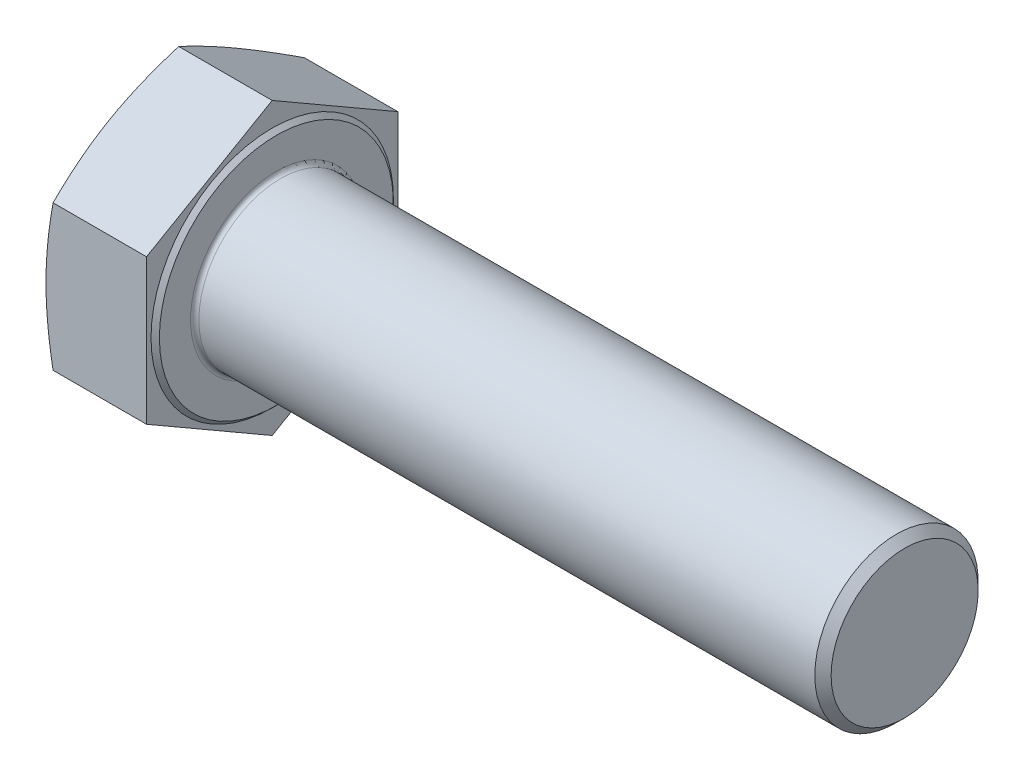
ISO-10303-21;
HEADER;
FILE_DESCRIPTION(('STEP AP214'),'2;1');
FILE_NAME('part.step','',(''),(''),'','','');
FILE_SCHEMA(('AUTOMOTIVE_DESIGN { 1 0 10303 214 1 1 1 1 }'));
ENDSEC;
DATA;
#1=APPLICATION_CONTEXT('core data for automotive mechanical design processes');
#2=APPLICATION_PROTOCOL_DEFINITION('international standard','automotive_design',2000,#1);
#3=PRODUCT_CONTEXT('',#1,'mechanical');
#4=PRODUCT('Part','Part','',(#3));
#5=PRODUCT_RELATED_PRODUCT_CATEGORY('part','',(#4));
#6=PRODUCT_DEFINITION_FORMATION('','',#4);
#7=PRODUCT_DEFINITION_CONTEXT('part definition',#1,'design');
#8=PRODUCT_DEFINITION('design','',#6,#7);
#9=PRODUCT_DEFINITION_SHAPE('','',#8);
#10=(LENGTH_UNIT() NAMED_UNIT(*) SI_UNIT(.MILLI.,.METRE.));
#11=(NAMED_UNIT(*) PLANE_ANGLE_UNIT() SI_UNIT($,.RADIAN.));
#12=(NAMED_UNIT(*) SI_UNIT($,.STERADIAN.) SOLID_ANGLE_UNIT());
#13=UNCERTAINTY_MEASURE_WITH_UNIT(LENGTH_MEASURE(1.E-05),#10,'distance_accuracy_value','');
#14=(GEOMETRIC_REPRESENTATION_CONTEXT(3) GLOBAL_UNCERTAINTY_ASSIGNED_CONTEXT((#13)) GLOBAL_UNIT_ASSIGNED_CONTEXT((#10,
#11,#12)) REPRESENTATION_CONTEXT('',''));
#15=CARTESIAN_POINT('',(0.,0.,0.));
#16=DIRECTION('',(0.,0.,1.));
#17=DIRECTION('',(1.,0.,0.));
#18=AXIS2_PLACEMENT_3D('',#15,#16,#17);
#19=CARTESIAN_POINT('',(25.,-51.9615242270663,-30.));
#20=DIRECTION('',(1.,0.,0.));
#21=DIRECTION('',(0.,0.,-1.));
#22=AXIS2_PLACEMENT_3D('',#19,#20,#21);
#23=PLANE('',#22);
#24=CARTESIAN_POINT('',(25.,0.,0.));
#25=DIRECTION('',(1.,0.,0.));
#26=DIRECTION('',(0.,0.,-1.));
#27=AXIS2_PLACEMENT_3D('',#24,#25,#26);
#28=CIRCLE('',#27,20.5);
#29=CARTESIAN_POINT('',(25.,0.,-20.5));
#30=VERTEX_POINT('',#29);
#31=EDGE_CURVE('E11',#30,#30,#28,.F.);
#32=ORIENTED_EDGE('',*,*,#31,.T.);
#33=EDGE_LOOP('',(#32));
#34=FACE_BOUND('',#33,.T.);
#35=CARTESIAN_POINT('',(25.,0.,0.));
#36=DIRECTION('',(-1.,0.,0.));
#37=DIRECTION('',(0.,0.,1.));
#38=AXIS2_PLACEMENT_3D('',#35,#36,#37);
#39=CIRCLE('',#38,27.93);
#40=CARTESIAN_POINT('',(25.,0.,27.93));
#41=VERTEX_POINT('',#40);
#42=EDGE_CURVE('E257',#41,#41,#39,.T.);
#43=ORIENTED_EDGE('',*,*,#42,.F.);
#44=EDGE_LOOP('',(#43));
#45=FACE_BOUND('',#44,.T.);
#46=ADVANCED_FACE('F32',(#34,#45),#23,.T.);
#47=CARTESIAN_POINT('',(25.,-17.3205080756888,30.));
#48=DIRECTION('',(0.,0.866025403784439,-0.5));
#49=DIRECTION('',(0.,0.5,0.866025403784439));
#50=AXIS2_PLACEMENT_3D('',#47,#48,#49);
#51=PLANE('',#50);
#52=CARTESIAN_POINT('',(1.68923376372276,-34.6411316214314,-0.00019999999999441));
#53=CARTESIAN_POINT('',(1.55868686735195,-34.2824499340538,0.621054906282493));
#54=CARTESIAN_POINT('',(1.43401492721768,-33.9232210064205,1.2432576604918));
#55=CARTESIAN_POINT('',(1.19770444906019,-33.2036598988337,2.48957405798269));
#56=CARTESIAN_POINT('',(1.08606715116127,-32.8433276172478,3.11368787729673));
#57=CARTESIAN_POINT('',(0.877055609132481,-32.1213458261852,4.36419702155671));
#58=CARTESIAN_POINT('',(0.779692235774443,-31.7596955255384,4.99059371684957));
#59=CARTESIAN_POINT('',(0.600620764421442,-31.0354291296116,6.24505991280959));
#60=CARTESIAN_POINT('',(0.518912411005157,-30.6728130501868,6.87312938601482));
#61=CARTESIAN_POINT('',(0.373046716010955,-29.9501512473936,8.12481634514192));
#62=CARTESIAN_POINT('',(0.308731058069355,-29.5901135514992,8.7484199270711));
#63=CARTESIAN_POINT('',(0.19766503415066,-28.8693558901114,9.99680881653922));
#64=CARTESIAN_POINT('',(0.150914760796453,-28.5086359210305,10.621594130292));
#65=CARTESIAN_POINT('',(0.0757926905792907,-27.786847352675,11.8717686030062));
#66=CARTESIAN_POINT('',(0.0474141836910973,-27.4257789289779,12.4971574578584));
#67=CARTESIAN_POINT('',(0.00951786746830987,-26.7033943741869,13.7483642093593));
#68=CARTESIAN_POINT('',(0.,-26.34207824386,14.3741821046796));
#69=CARTESIAN_POINT('',(0.,-25.6194459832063,15.6258178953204));
#70=CARTESIAN_POINT('',(0.00951786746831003,-25.2581298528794,16.2516357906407));
#71=CARTESIAN_POINT('',(0.0474141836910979,-24.5357452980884,17.5028425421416));
#72=CARTESIAN_POINT('',(0.0757926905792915,-24.1746768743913,18.1282313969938));
#73=CARTESIAN_POINT('',(0.150914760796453,-23.4528883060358,19.378405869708));
#74=CARTESIAN_POINT('',(0.19766503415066,-23.0921683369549,20.0031911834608));
#75=CARTESIAN_POINT('',(0.308731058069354,-22.3714106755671,21.2515800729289));
#76=CARTESIAN_POINT('',(0.373046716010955,-22.0113729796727,21.8751836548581));
#77=CARTESIAN_POINT('',(0.518912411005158,-21.2887111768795,23.1268706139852));
#78=CARTESIAN_POINT('',(0.600620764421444,-20.9260950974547,23.7549400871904));
#79=CARTESIAN_POINT('',(0.779692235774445,-20.2018287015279,25.0094062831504));
#80=CARTESIAN_POINT('',(0.877055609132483,-19.8401784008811,25.6358029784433));
#81=CARTESIAN_POINT('',(1.08606715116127,-19.1181966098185,26.8863121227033));
#82=CARTESIAN_POINT('',(1.19770444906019,-18.7578643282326,27.5104259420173));
#83=CARTESIAN_POINT('',(1.43401492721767,-18.0383032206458,28.7567423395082));
#84=CARTESIAN_POINT('',(1.55868686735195,-17.6790742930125,29.3789450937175));
#85=CARTESIAN_POINT('',(1.68923376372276,-17.3203926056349,30.0002));
#86=B_SPLINE_CURVE_WITH_KNOTS('',3,(#52,#53,#54,#55,#56,#57,#58,#59,#60,#61,#62,#63,#64,#65,#66,
#67,#68,#69,#70,#71,#72,#73,#74,#75,#76,#77,#78,#79,#80,#81,#82,#83,#84,#85),.UNSPECIFIED.,.F.,
.F.,(4,2,2,2,2,2,2,2,2,2,2,2,2,2,2,2,4),(0.,2.18744819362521,4.3751043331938,6.56441799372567,
8.7536959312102,10.9223185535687,13.0909526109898,15.2587941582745,17.4266290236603,
19.5944638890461,21.7623054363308,23.9309394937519,26.0995621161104,28.2888400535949,
30.4781537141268,32.6658098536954,34.8532580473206),.UNSPECIFIED.);
#87=CARTESIAN_POINT('',(1.68919173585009,-34.6410161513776,0.));
#88=VERTEX_POINT('',#87);
#89=CARTESIAN_POINT('',(0.,-25.9807621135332,15.));
#90=VERTEX_POINT('',#89);
#91=EDGE_CURVE('E276',#88,#90,#86,.T.);
#92=ORIENTED_EDGE('',*,*,#91,.F.);
#93=DIRECTION('',(-1.,0.,0.));
#94=VECTOR('',#93,1.);
#95=CARTESIAN_POINT('',(25.,-34.6410161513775,0.));
#96=LINE('',#95,#94);
#97=CARTESIAN_POINT('',(24.,-34.6410161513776,0.));
#98=VERTEX_POINT('',#97);
#99=EDGE_CURVE('E142',#98,#88,#96,.T.);
#100=ORIENTED_EDGE('',*,*,#99,.F.);
#101=DIRECTION('',(0.,-0.5,-0.866025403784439));
#102=VECTOR('',#101,1.);
#103=CARTESIAN_POINT('',(24.,-17.3205080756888,30.));
#104=LINE('',#103,#102);
#105=CARTESIAN_POINT('',(24.,-17.3205080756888,30.));
#106=VERTEX_POINT('',#105);
#107=EDGE_CURVE('E133',#106,#98,#104,.T.);
#108=ORIENTED_EDGE('',*,*,#107,.F.);
#109=DIRECTION('',(-1.,0.,0.));
#110=VECTOR('',#109,1.);
#111=CARTESIAN_POINT('',(25.,-17.3205080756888,30.));
#112=LINE('',#111,#110);
#113=CARTESIAN_POINT('',(1.68919173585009,-17.3205080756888,30.));
#114=VERTEX_POINT('',#113);
#115=EDGE_CURVE('E128',#106,#114,#112,.T.);
#116=ORIENTED_EDGE('',*,*,#115,.T.);
#117=EDGE_CURVE('E121',#90,#114,#86,.T.);
#118=ORIENTED_EDGE('',*,*,#117,.F.);
#119=EDGE_LOOP('',(#92,#100,#108,#116,#118));
#120=FACE_BOUND('',#119,.T.);
#121=ADVANCED_FACE('F34',(#120),#51,.F.);
#122=CARTESIAN_POINT('',(25.,-34.6410161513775,0.));
#123=DIRECTION('',(0.,0.866025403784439,0.5));
#124=DIRECTION('',(0.,-0.5,0.866025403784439));
#125=AXIS2_PLACEMENT_3D('',#122,#123,#124);
#126=PLANE('',#125);
#127=CARTESIAN_POINT('',(1.68923376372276,-17.3203926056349,-30.0002));
#128=CARTESIAN_POINT('',(1.55868686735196,-17.6790742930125,-29.3789450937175));
#129=CARTESIAN_POINT('',(1.43401492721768,-18.0383032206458,-28.7567423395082));
#130=CARTESIAN_POINT('',(1.1977044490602,-18.7578643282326,-27.5104259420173));
#131=CARTESIAN_POINT('',(1.08606715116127,-19.1181966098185,-26.8863121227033));
#132=CARTESIAN_POINT('',(0.877055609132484,-19.8401784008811,-25.6358029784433));
#133=CARTESIAN_POINT('',(0.779692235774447,-20.2018287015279,-25.0094062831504));
#134=CARTESIAN_POINT('',(0.600620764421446,-20.9260950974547,-23.7549400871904));
#135=CARTESIAN_POINT('',(0.518912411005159,-21.2887111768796,-23.1268706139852));
#136=CARTESIAN_POINT('',(0.373046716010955,-22.0113729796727,-21.8751836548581));
#137=CARTESIAN_POINT('',(0.308731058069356,-22.3714106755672,-21.2515800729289));
#138=CARTESIAN_POINT('',(0.197665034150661,-23.0921683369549,-20.0031911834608));
#139=CARTESIAN_POINT('',(0.150914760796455,-23.4528883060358,-19.378405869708));
#140=CARTESIAN_POINT('',(0.075792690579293,-24.1746768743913,-18.1282313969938));
#141=CARTESIAN_POINT('',(0.0474141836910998,-24.5357452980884,-17.5028425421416));
#142=CARTESIAN_POINT('',(0.00951786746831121,-25.2581298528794,-16.2516357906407));
#143=CARTESIAN_POINT('',(0.,-25.6194459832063,-15.6258178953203));
#144=CARTESIAN_POINT('',(0.,-26.34207824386,-14.3741821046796));
#145=CARTESIAN_POINT('',(0.00951786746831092,-26.7033943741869,-13.7483642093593));
#146=CARTESIAN_POINT('',(0.0474141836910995,-27.4257789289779,-12.4971574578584));
#147=CARTESIAN_POINT('',(0.0757926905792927,-27.786847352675,-11.8717686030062));
#148=CARTESIAN_POINT('',(0.150914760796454,-28.5086359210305,-10.621594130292));
#149=CARTESIAN_POINT('',(0.197665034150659,-28.8693558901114,-9.99680881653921));
#150=CARTESIAN_POINT('',(0.308731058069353,-29.5901135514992,-8.74841992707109));
#151=CARTESIAN_POINT('',(0.373046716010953,-29.9501512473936,-8.12481634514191));
#152=CARTESIAN_POINT('',(0.518912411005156,-30.6728130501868,-6.87312938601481));
#153=CARTESIAN_POINT('',(0.600620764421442,-31.0354291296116,-6.24505991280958));
#154=CARTESIAN_POINT('',(0.779692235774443,-31.7596955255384,-4.99059371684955));
#155=CARTESIAN_POINT('',(0.877055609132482,-32.1213458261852,-4.3641970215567));
#156=CARTESIAN_POINT('',(1.08606715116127,-32.8433276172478,-3.11368787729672));
#157=CARTESIAN_POINT('',(1.19770444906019,-33.2036598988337,-2.48957405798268));
#158=CARTESIAN_POINT('',(1.43401492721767,-33.9232210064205,-1.24325766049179));
#159=CARTESIAN_POINT('',(1.55868686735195,-34.2824499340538,-0.621054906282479));
#160=CARTESIAN_POINT('',(1.68923376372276,-34.6411316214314,0.000200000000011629));
#161=B_SPLINE_CURVE_WITH_KNOTS('',3,(#127,#128,#129,#130,#131,#132,#133,#134,#135,#136,#137,
#138,#139,#140,#141,#142,#143,#144,#145,#146,#147,#148,#149,#150,#151,#152,#153,#154,#155,#156,
#157,#158,#159,#160),.UNSPECIFIED.,.F.,.F.,(4,2,2,2,2,2,2,2,2,2,2,2,2,2,2,2,4),(0.,
2.18744819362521,4.3751043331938,6.56441799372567,8.7536959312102,10.9223185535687,
13.0909526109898,15.2587941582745,17.4266290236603,19.5944638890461,21.7623054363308,
23.9309394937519,26.0995621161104,28.2888400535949,30.4781537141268,32.6658098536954,
34.8532580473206),.UNSPECIFIED.);
#162=CARTESIAN_POINT('',(1.68919173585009,-17.3205080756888,-30.));
#163=VERTEX_POINT('',#162);
#164=CARTESIAN_POINT('',(0.,-25.9807621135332,-15.));
#165=VERTEX_POINT('',#164);
#166=EDGE_CURVE('E229',#163,#165,#161,.T.);
#167=ORIENTED_EDGE('',*,*,#166,.F.);
#168=DIRECTION('',(-1.,0.,0.));
#169=VECTOR('',#168,1.);
#170=CARTESIAN_POINT('',(25.,-17.3205080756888,-30.));
#171=LINE('',#170,#169);
#172=CARTESIAN_POINT('',(24.,-17.3205080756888,-30.));
#173=VERTEX_POINT('',#172);
#174=EDGE_CURVE('E139',#173,#163,#171,.T.);
#175=ORIENTED_EDGE('',*,*,#174,.F.);
#176=DIRECTION('',(0.,0.5,-0.866025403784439));
#177=VECTOR('',#176,1.);
#178=CARTESIAN_POINT('',(24.,-34.6410161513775,0.));
#179=LINE('',#178,#177);
#180=EDGE_CURVE('E266',#98,#173,#179,.T.);
#181=ORIENTED_EDGE('',*,*,#180,.F.);
#182=ORIENTED_EDGE('',*,*,#99,.T.);
#183=EDGE_CURVE('E225',#165,#88,#161,.T.);
#184=ORIENTED_EDGE('',*,*,#183,.F.);
#185=EDGE_LOOP('',(#167,#175,#181,#182,#184));
#186=FACE_BOUND('',#185,.T.);
#187=ADVANCED_FACE('F180',(#186),#126,.F.);
#188=CARTESIAN_POINT('',(25.,-17.3205080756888,-30.));
#189=DIRECTION('',(0.,0.,1.));
#190=DIRECTION('',(1.,0.,0.));
#191=AXIS2_PLACEMENT_3D('',#188,#189,#190);
#192=PLANE('',#191);
#193=CARTESIAN_POINT('',(9.02637073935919,-45.8586150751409,-30.));
#194=CARTESIAN_POINT('',(8.81967026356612,-45.1799707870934,-30.));
#195=CARTESIAN_POINT('',(8.61421981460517,-44.5009459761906,-30.));
#196=CARTESIAN_POINT('',(8.20609881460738,-43.1420573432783,-30.));
#197=CARTESIAN_POINT('',(8.00342827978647,-42.4621935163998,-30.));
#198=CARTESIAN_POINT('',(7.39998018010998,-40.4211378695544,-30.));
#199=CARTESIAN_POINT('',(7.0037967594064,-39.0585821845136,-30.));
#200=CARTESIAN_POINT('',(6.2257778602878,-36.3266214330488,-30.));
#201=CARTESIAN_POINT('',(5.84397053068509,-34.9572083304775,-30.));
#202=CARTESIAN_POINT('',(5.09914101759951,-32.2132888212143,-30.));
#203=CARTESIAN_POINT('',(4.73611849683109,-30.8387825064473,-30.));
#204=CARTESIAN_POINT('',(4.03785279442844,-28.1007443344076,-30.));
#205=CARTESIAN_POINT('',(3.70232229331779,-26.7372861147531,-30.));
#206=CARTESIAN_POINT('',(3.05982708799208,-24.003585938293,-30.));
#207=CARTESIAN_POINT('',(2.75286286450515,-22.6333438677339,-30.));
#208=CARTESIAN_POINT('',(2.17465811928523,-19.8857647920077,-30.));
#209=CARTESIAN_POINT('',(1.9034054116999,-18.5084303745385,-30.));
#210=CARTESIAN_POINT('',(1.40488047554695,-15.745778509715,-30.));
#211=CARTESIAN_POINT('',(1.17760677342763,-14.3604613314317,-30.));
#212=CARTESIAN_POINT('',(0.798785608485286,-11.7377758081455,-30.));
#213=CARTESIAN_POINT('',(0.641604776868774,-10.501233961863,-30.));
#214=CARTESIAN_POINT('',(0.44203025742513,-8.64256639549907,-30.));
#215=CARTESIAN_POINT('',(0.381537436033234,-8.02235678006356,-30.));
#216=CARTESIAN_POINT('',(0.273298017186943,-6.78083204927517,-30.));
#217=CARTESIAN_POINT('',(0.225551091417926,-6.15951696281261,-30.));
#218=CARTESIAN_POINT('',(0.143420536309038,-4.9164307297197,-30.));
#219=CARTESIAN_POINT('',(0.109027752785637,-4.29466018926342,-30.));
#220=CARTESIAN_POINT('',(0.0540031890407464,-3.05050798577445,-30.));
#221=CARTESIAN_POINT('',(0.0333713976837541,-2.4281263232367,-30.));
#222=CARTESIAN_POINT('',(0.00614623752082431,-1.18305707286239,-30.));
#223=CARTESIAN_POINT('',(-0.000447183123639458,-0.560369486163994,-30.));
#224=CARTESIAN_POINT('',(0.000494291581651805,0.684995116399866,-30.));
#225=CARTESIAN_POINT('',(0.00802919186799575,1.30767213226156,-30.));
#226=CARTESIAN_POINT('',(0.0371982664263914,2.5558523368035,-30.));
#227=CARTESIAN_POINT('',(0.0589037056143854,3.18135385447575,-30.));
#228=CARTESIAN_POINT('',(0.116188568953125,4.43171840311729,-30.));
#229=CARTESIAN_POINT('',(0.151768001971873,5.05658143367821,-30.));
#230=CARTESIAN_POINT('',(0.236338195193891,6.30539836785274,-30.));
#231=CARTESIAN_POINT('',(0.285328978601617,6.92935226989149,-30.));
#232=CARTESIAN_POINT('',(0.396114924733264,8.1761280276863,-30.));
#233=CARTESIAN_POINT('',(0.457910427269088,8.79894985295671,-30.));
#234=CARTESIAN_POINT('',(0.661568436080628,10.6664531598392,-30.));
#235=CARTESIAN_POINT('',(0.821633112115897,11.9091794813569,-30.));
#236=CARTESIAN_POINT('',(1.18384610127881,14.3883728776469,-30.));
#237=CARTESIAN_POINT('',(1.38599463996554,15.6248399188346,-30.));
#238=CARTESIAN_POINT('',(1.83742065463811,18.156633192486,-30.));
#239=CARTESIAN_POINT('',(2.0886254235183,19.4516133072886,-30.));
#240=CARTESIAN_POINT('',(2.62336703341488,22.034920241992,-30.));
#241=CARTESIAN_POINT('',(2.9069063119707,23.3232465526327,-30.));
#242=CARTESIAN_POINT('',(3.50036258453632,25.8941681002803,-30.));
#243=CARTESIAN_POINT('',(3.81028723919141,27.1767615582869,-30.));
#244=CARTESIAN_POINT('',(4.4514728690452,29.7365452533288,-30.));
#245=CARTESIAN_POINT('',(4.78273333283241,31.0137356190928,-30.));
#246=CARTESIAN_POINT('',(5.46303895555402,33.5651110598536,-30.));
#247=CARTESIAN_POINT('',(5.81210640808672,34.8392901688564,-30.));
#248=CARTESIAN_POINT('',(6.52444101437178,37.3836675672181,-30.));
#249=CARTESIAN_POINT('',(6.88770822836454,38.6538658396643,-30.));
#250=CARTESIAN_POINT('',(7.62584333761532,41.1906487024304,-30.));
#251=CARTESIAN_POINT('',(8.00070927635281,42.4572338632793,-30.));
#252=CARTESIAN_POINT('',(8.76008460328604,44.9875022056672,-30.));
#253=CARTESIAN_POINT('',(9.14459397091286,46.2511853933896,-30.));
#254=CARTESIAN_POINT('',(9.91736032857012,48.7621368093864,-30.));
#255=CARTESIAN_POINT('',(10.3055290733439,50.0094322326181,-30.));
#256=CARTESIAN_POINT('',(11.0884787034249,52.5019440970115,-30.));
#257=CARTESIAN_POINT('',(11.483259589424,53.7471605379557,-30.));
#258=CARTESIAN_POINT('',(12.2784404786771,56.2358593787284,-30.));
#259=CARTESIAN_POINT('',(12.6788407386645,57.4793416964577,-30.));
#260=CARTESIAN_POINT('',(13.4844190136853,59.964758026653,-30.));
#261=CARTESIAN_POINT('',(13.8895970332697,61.206692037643,-30.));
#262=CARTESIAN_POINT('',(14.7025081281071,63.6845021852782,-30.));
#263=CARTESIAN_POINT('',(15.1102256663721,64.9203834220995,-30.));
#264=CARTESIAN_POINT('',(15.9291790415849,67.3909799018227,-30.));
#265=CARTESIAN_POINT('',(16.3404148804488,68.6256951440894,-30.));
#266=CARTESIAN_POINT('',(17.1659073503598,71.0940025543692,-30.));
#267=CARTESIAN_POINT('',(17.5801637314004,72.327594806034,-30.));
#268=CARTESIAN_POINT('',(18.4113570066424,74.7938727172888,-30.));
#269=CARTESIAN_POINT('',(18.8282938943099,76.0265583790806,-30.));
#270=CARTESIAN_POINT('',(19.246385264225,77.2588513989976,-30.));
#271=B_SPLINE_CURVE_WITH_KNOTS('',3,(#193,#194,#195,#196,#197,#198,#199,#200,#201,#202,#203,
#204,#205,#206,#207,#208,#209,#210,#211,#212,#213,#214,#215,#216,#217,#218,#219,#220,#221,#222,
#223,#224,#225,#226,#227,#228,#229,#230,#231,#232,#233,#234,#235,#236,#237,#238,#239,#240,#241,
#242,#243,#244,#245,#246,#247,#248,#249,#250,#251,#252,#253,#254,#255,#256,#257,#258,#259,#260,
#261,#262,#263,#264,#265,#266,#267,#268,#269,#270),.UNSPECIFIED.,.F.,.F.,(4,2,2,2,2,2,2,2,2,2,2,
2,2,2,2,2,2,2,2,2,2,2,2,2,2,2,2,2,2,2,2,2,2,2,2,2,2,2,4),(0.,2.12827131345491,4.25655503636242,
8.51343710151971,12.778261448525,17.0430091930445,21.2551748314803,25.4674113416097,
29.6782067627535,33.8888610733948,37.6274208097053,39.4967685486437,41.3660681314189,
43.234084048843,45.1020984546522,46.9701059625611,48.8381141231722,50.7155897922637,
52.5930666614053,54.4705467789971,56.3480767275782,60.1061206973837,63.8641848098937,
67.8210310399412,71.7781757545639,75.7364733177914,79.6946760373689,83.6579620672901,
87.6212649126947,91.5839028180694,95.5465322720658,99.4654120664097,103.384292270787,
107.303352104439,111.222415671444,115.126602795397,119.030792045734,122.934661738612,
126.838521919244),.UNSPECIFIED.);
#272=CARTESIAN_POINT('',(1.68919173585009,17.3205080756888,-30.));
#273=VERTEX_POINT('',#272);
#274=CARTESIAN_POINT('',(0.,0.,-30.));
#275=VERTEX_POINT('',#274);
#276=EDGE_CURVE('E292',#273,#275,#271,.F.);
#277=ORIENTED_EDGE('',*,*,#276,.F.);
#278=DIRECTION('',(-1.,0.,0.));
#279=VECTOR('',#278,1.);
#280=CARTESIAN_POINT('',(25.,17.3205080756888,-30.));
#281=LINE('',#280,#279);
#282=CARTESIAN_POINT('',(24.,17.3205080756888,-30.));
#283=VERTEX_POINT('',#282);
#284=EDGE_CURVE('E130',#283,#273,#281,.T.);
#285=ORIENTED_EDGE('',*,*,#284,.F.);
#286=DIRECTION('',(0.,1.,0.));
#287=VECTOR('',#286,1.);
#288=CARTESIAN_POINT('',(24.,-17.3205080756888,-30.));
#289=LINE('',#288,#287);
#290=EDGE_CURVE('E259',#173,#283,#289,.T.);
#291=ORIENTED_EDGE('',*,*,#290,.F.);
#292=ORIENTED_EDGE('',*,*,#174,.T.);
#293=EDGE_CURVE('E230',#275,#163,#271,.F.);
#294=ORIENTED_EDGE('',*,*,#293,.F.);
#295=EDGE_LOOP('',(#277,#285,#291,#292,#294));
#296=FACE_BOUND('',#295,.T.);
#297=ADVANCED_FACE('F238',(#296),#192,.F.);
#298=CARTESIAN_POINT('',(25.,17.3205080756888,-30.));
#299=DIRECTION('',(0.,-0.866025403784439,0.5));
#300=DIRECTION('',(0.,-0.5,-0.866025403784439));
#301=AXIS2_PLACEMENT_3D('',#298,#299,#300);
#302=PLANE('',#301);
#303=CARTESIAN_POINT('',(1.68923376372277,34.6411316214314,0.000199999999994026));
#304=CARTESIAN_POINT('',(1.55868686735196,34.2824499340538,-0.621054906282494));
#305=CARTESIAN_POINT('',(1.43401492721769,33.9232210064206,-1.24325766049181));
#306=CARTESIAN_POINT('',(1.1977044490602,33.2036598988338,-2.48957405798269));
#307=CARTESIAN_POINT('',(1.08606715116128,32.8433276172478,-3.11368787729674));
#308=CARTESIAN_POINT('',(0.877055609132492,32.1213458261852,-4.36419702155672));
#309=CARTESIAN_POINT('',(0.779692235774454,31.7596955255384,-4.99059371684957));
#310=CARTESIAN_POINT('',(0.600620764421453,31.0354291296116,-6.2450599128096));
#311=CARTESIAN_POINT('',(0.518912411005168,30.6728130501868,-6.87312938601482));
#312=CARTESIAN_POINT('',(0.373046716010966,29.9501512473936,-8.12481634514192));
#313=CARTESIAN_POINT('',(0.308731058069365,29.5901135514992,-8.7484199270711));
#314=CARTESIAN_POINT('',(0.19766503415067,28.8693558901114,-9.99680881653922));
#315=CARTESIAN_POINT('',(0.150914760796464,28.5086359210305,-10.621594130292));
#316=CARTESIAN_POINT('',(0.0757926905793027,27.786847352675,-11.8717686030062));
#317=CARTESIAN_POINT('',(0.0474141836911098,27.4257789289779,-12.4971574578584));
#318=CARTESIAN_POINT('',(0.00951786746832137,26.703394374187,-13.7483642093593));
#319=CARTESIAN_POINT('',(0.,26.3420782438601,-14.3741821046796));
#320=CARTESIAN_POINT('',(0.,25.6194459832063,-15.6258178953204));
#321=CARTESIAN_POINT('',(0.00951786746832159,25.2581298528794,-16.2516357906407));
#322=CARTESIAN_POINT('',(0.0474141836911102,24.5357452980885,-17.5028425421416));
#323=CARTESIAN_POINT('',(0.0757926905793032,24.1746768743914,-18.1282313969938));
#324=CARTESIAN_POINT('',(0.150914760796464,23.4528883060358,-19.378405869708));
#325=CARTESIAN_POINT('',(0.19766503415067,23.0921683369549,-20.0031911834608));
#326=CARTESIAN_POINT('',(0.308731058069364,22.3714106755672,-21.2515800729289));
#327=CARTESIAN_POINT('',(0.373046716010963,22.0113729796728,-21.8751836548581));
#328=CARTESIAN_POINT('',(0.518912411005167,21.2887111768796,-23.1268706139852));
#329=CARTESIAN_POINT('',(0.600620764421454,20.9260950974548,-23.7549400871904));
#330=CARTESIAN_POINT('',(0.779692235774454,20.201828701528,-25.0094062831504));
#331=CARTESIAN_POINT('',(0.87705560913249,19.8401784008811,-25.6358029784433));
#332=CARTESIAN_POINT('',(1.08606715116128,19.1181966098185,-26.8863121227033));
#333=CARTESIAN_POINT('',(1.1977044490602,18.7578643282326,-27.5104259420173));
#334=CARTESIAN_POINT('',(1.43401492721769,18.0383032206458,-28.7567423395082));
#335=CARTESIAN_POINT('',(1.55868686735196,17.6790742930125,-29.3789450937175));
#336=CARTESIAN_POINT('',(1.68923376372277,17.320392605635,-30.0002));
#337=B_SPLINE_CURVE_WITH_KNOTS('',3,(#303,#304,#305,#306,#307,#308,#309,#310,#311,#312,#313,
#314,#315,#316,#317,#318,#319,#320,#321,#322,#323,#324,#325,#326,#327,#328,#329,#330,#331,#332,
#333,#334,#335,#336),.UNSPECIFIED.,.F.,.F.,(4,2,2,2,2,2,2,2,2,2,2,2,2,2,2,2,4),(0.,
2.18744819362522,4.37510433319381,6.56441799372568,8.7536959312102,10.9223185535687,
13.0909526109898,15.2587941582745,17.4266290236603,19.5944638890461,21.7623054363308,
23.9309394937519,26.0995621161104,28.2888400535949,30.4781537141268,32.6658098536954,
34.8532580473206),.UNSPECIFIED.);
#338=CARTESIAN_POINT('',(1.68919173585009,34.6410161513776,0.));
#339=VERTEX_POINT('',#338);
#340=CARTESIAN_POINT('',(0.,25.9807621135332,-15.));
#341=VERTEX_POINT('',#340);
#342=EDGE_CURVE('E48',#339,#341,#337,.T.);
#343=ORIENTED_EDGE('',*,*,#342,.F.);
#344=DIRECTION('',(-1.,0.,0.));
#345=VECTOR('',#344,1.);
#346=CARTESIAN_POINT('',(25.,34.6410161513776,0.));
#347=LINE('',#346,#345);
#348=CARTESIAN_POINT('',(24.,34.6410161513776,0.));
#349=VERTEX_POINT('',#348);
#350=EDGE_CURVE('E127',#349,#339,#347,.T.);
#351=ORIENTED_EDGE('',*,*,#350,.F.);
#352=DIRECTION('',(0.,0.5,0.866025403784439));
#353=VECTOR('',#352,1.);
#354=CARTESIAN_POINT('',(24.,17.3205080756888,-30.));
#355=LINE('',#354,#353);
#356=EDGE_CURVE('E256',#283,#349,#355,.T.);
#357=ORIENTED_EDGE('',*,*,#356,.F.);
#358=ORIENTED_EDGE('',*,*,#284,.T.);
#359=EDGE_CURVE('E253',#341,#273,#337,.T.);
#360=ORIENTED_EDGE('',*,*,#359,.F.);
#361=EDGE_LOOP('',(#343,#351,#357,#358,#360));
#362=FACE_BOUND('',#361,.T.);
#363=ADVANCED_FACE('F242',(#362),#302,.F.);
#364=CARTESIAN_POINT('',(25.,34.6410161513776,0.));
#365=DIRECTION('',(0.,-0.866025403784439,-0.5));
#366=DIRECTION('',(0.,0.5,-0.866025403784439));
#367=AXIS2_PLACEMENT_3D('',#364,#365,#366);
#368=PLANE('',#367);
#369=CARTESIAN_POINT('',(1.68923376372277,17.320392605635,30.0002));
#370=CARTESIAN_POINT('',(1.55868686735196,17.6790742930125,29.3789450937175));
#371=CARTESIAN_POINT('',(1.43401492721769,18.0383032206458,28.7567423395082));
#372=CARTESIAN_POINT('',(1.1977044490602,18.7578643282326,27.5104259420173));
#373=CARTESIAN_POINT('',(1.08606715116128,19.1181966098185,26.8863121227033));
#374=CARTESIAN_POINT('',(0.87705560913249,19.8401784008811,25.6358029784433));
#375=CARTESIAN_POINT('',(0.779692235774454,20.2018287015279,25.0094062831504));
#376=CARTESIAN_POINT('',(0.600620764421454,20.9260950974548,23.7549400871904));
#377=CARTESIAN_POINT('',(0.518912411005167,21.2887111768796,23.1268706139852));
#378=CARTESIAN_POINT('',(0.373046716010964,22.0113729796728,21.8751836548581));
#379=CARTESIAN_POINT('',(0.308731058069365,22.3714106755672,21.2515800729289));
#380=CARTESIAN_POINT('',(0.19766503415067,23.0921683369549,20.0031911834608));
#381=CARTESIAN_POINT('',(0.150914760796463,23.4528883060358,19.378405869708));
#382=CARTESIAN_POINT('',(0.0757926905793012,24.1746768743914,18.1282313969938));
#383=CARTESIAN_POINT('',(0.0474141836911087,24.5357452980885,17.5028425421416));
#384=CARTESIAN_POINT('',(0.00951786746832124,25.2581298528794,16.2516357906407));
#385=CARTESIAN_POINT('',(0.,25.6194459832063,15.6258178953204));
#386=CARTESIAN_POINT('',(0.,26.3420782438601,14.3741821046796));
#387=CARTESIAN_POINT('',(0.00951786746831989,26.703394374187,13.7483642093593));
#388=CARTESIAN_POINT('',(0.0474141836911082,27.4257789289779,12.4971574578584));
#389=CARTESIAN_POINT('',(0.0757926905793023,27.786847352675,11.8717686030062));
#390=CARTESIAN_POINT('',(0.150914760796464,28.5086359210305,10.621594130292));
#391=CARTESIAN_POINT('',(0.197665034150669,28.8693558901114,9.99680881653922));
#392=CARTESIAN_POINT('',(0.308731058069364,29.5901135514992,8.7484199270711));
#393=CARTESIAN_POINT('',(0.373046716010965,29.9501512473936,8.12481634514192));
#394=CARTESIAN_POINT('',(0.518912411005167,30.6728130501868,6.87312938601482));
#395=CARTESIAN_POINT('',(0.600620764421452,31.0354291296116,6.24505991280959));
#396=CARTESIAN_POINT('',(0.779692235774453,31.7596955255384,4.99059371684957));
#397=CARTESIAN_POINT('',(0.877055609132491,32.1213458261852,4.36419702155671));
#398=CARTESIAN_POINT('',(1.08606715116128,32.8433276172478,3.11368787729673));
#399=CARTESIAN_POINT('',(1.1977044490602,33.2036598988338,2.48957405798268));
#400=CARTESIAN_POINT('',(1.43401492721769,33.9232210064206,1.2432576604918));
#401=CARTESIAN_POINT('',(1.55868686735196,34.2824499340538,0.621054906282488));
#402=CARTESIAN_POINT('',(1.68923376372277,34.6411316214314,-0.000200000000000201));
#403=B_SPLINE_CURVE_WITH_KNOTS('',3,(#369,#370,#371,#372,#373,#374,#375,#376,#377,#378,#379,
#380,#381,#382,#383,#384,#385,#386,#387,#388,#389,#390,#391,#392,#393,#394,#395,#396,#397,#398,
#399,#400,#401,#402),.UNSPECIFIED.,.F.,.F.,(4,2,2,2,2,2,2,2,2,2,2,2,2,2,2,2,4),(0.,
2.18744819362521,4.3751043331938,6.56441799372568,8.7536959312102,10.9223185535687,
13.0909526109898,15.2587941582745,17.4266290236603,19.5944638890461,21.7623054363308,
23.9309394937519,26.0995621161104,28.2888400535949,30.4781537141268,32.6658098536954,
34.8532580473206),.UNSPECIFIED.);
#404=CARTESIAN_POINT('',(1.68919173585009,17.3205080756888,30.));
#405=VERTEX_POINT('',#404);
#406=CARTESIAN_POINT('',(0.,25.9807621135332,15.));
#407=VERTEX_POINT('',#406);
#408=EDGE_CURVE('E56',#405,#407,#403,.T.);
#409=ORIENTED_EDGE('',*,*,#408,.F.);
#410=DIRECTION('',(-1.,0.,0.));
#411=VECTOR('',#410,1.);
#412=CARTESIAN_POINT('',(25.,17.3205080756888,30.));
#413=LINE('',#412,#411);
#414=CARTESIAN_POINT('',(24.,17.3205080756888,30.));
#415=VERTEX_POINT('',#414);
#416=EDGE_CURVE('E118',#415,#405,#413,.T.);
#417=ORIENTED_EDGE('',*,*,#416,.F.);
#418=DIRECTION('',(0.,-0.5,0.866025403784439));
#419=VECTOR('',#418,1.);
#420=CARTESIAN_POINT('',(24.,34.6410161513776,0.));
#421=LINE('',#420,#419);
#422=EDGE_CURVE('E254',#349,#415,#421,.T.);
#423=ORIENTED_EDGE('',*,*,#422,.F.);
#424=ORIENTED_EDGE('',*,*,#350,.T.);
#425=EDGE_CURVE('E120',#407,#339,#403,.T.);
#426=ORIENTED_EDGE('',*,*,#425,.F.);
#427=EDGE_LOOP('',(#409,#417,#423,#424,#426));
#428=FACE_BOUND('',#427,.T.);
#429=ADVANCED_FACE('F116',(#428),#368,.F.);
#430=CARTESIAN_POINT('',(25.,17.3205080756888,30.));
#431=DIRECTION('',(0.,0.,-1.));
#432=DIRECTION('',(0.,1.,0.));
#433=AXIS2_PLACEMENT_3D('',#430,#431,#432);
#434=PLANE('',#433);
#435=CARTESIAN_POINT('',(9.02637073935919,-45.8586150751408,30.));
#436=CARTESIAN_POINT('',(8.81967026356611,-45.1799707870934,30.));
#437=CARTESIAN_POINT('',(8.61421981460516,-44.5009459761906,30.));
#438=CARTESIAN_POINT('',(8.20609881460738,-43.1420573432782,30.));
#439=CARTESIAN_POINT('',(8.00342827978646,-42.4621935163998,30.));
#440=CARTESIAN_POINT('',(7.39998018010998,-40.4211378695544,30.));
#441=CARTESIAN_POINT('',(7.0037967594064,-39.0585821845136,30.));
#442=CARTESIAN_POINT('',(6.22577786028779,-36.3266214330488,30.));
#443=CARTESIAN_POINT('',(5.84397053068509,-34.9572083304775,30.));
#444=CARTESIAN_POINT('',(5.09914101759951,-32.2132888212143,30.));
#445=CARTESIAN_POINT('',(4.73611849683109,-30.8387825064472,30.));
#446=CARTESIAN_POINT('',(4.03785279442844,-28.1007443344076,30.));
#447=CARTESIAN_POINT('',(3.70232229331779,-26.7372861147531,30.));
#448=CARTESIAN_POINT('',(3.05982708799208,-24.003585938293,30.));
#449=CARTESIAN_POINT('',(2.75286286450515,-22.6333438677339,30.));
#450=CARTESIAN_POINT('',(2.17465811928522,-19.8857647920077,30.));
#451=CARTESIAN_POINT('',(1.90340541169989,-18.5084303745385,30.));
#452=CARTESIAN_POINT('',(1.40488047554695,-15.745778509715,30.));
#453=CARTESIAN_POINT('',(1.17760677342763,-14.3604613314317,30.));
#454=CARTESIAN_POINT('',(0.798785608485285,-11.7377758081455,30.));
#455=CARTESIAN_POINT('',(0.641604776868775,-10.501233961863,30.));
#456=CARTESIAN_POINT('',(0.44203025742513,-8.64256639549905,30.));
#457=CARTESIAN_POINT('',(0.381537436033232,-8.02235678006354,30.));
#458=CARTESIAN_POINT('',(0.273298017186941,-6.78083204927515,30.));
#459=CARTESIAN_POINT('',(0.225551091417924,-6.15951696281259,30.));
#460=CARTESIAN_POINT('',(0.143420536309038,-4.91643072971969,30.));
#461=CARTESIAN_POINT('',(0.109027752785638,-4.29466018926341,30.));
#462=CARTESIAN_POINT('',(0.0540031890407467,-3.05050798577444,30.));
#463=CARTESIAN_POINT('',(0.0333713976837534,-2.42812632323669,30.));
#464=CARTESIAN_POINT('',(0.00614623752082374,-1.18305707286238,30.));
#465=CARTESIAN_POINT('',(-0.000447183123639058,-0.560369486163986,30.));
#466=CARTESIAN_POINT('',(0.000494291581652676,0.684995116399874,30.));
#467=CARTESIAN_POINT('',(0.00802919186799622,1.30767213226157,30.));
#468=CARTESIAN_POINT('',(0.0371982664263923,2.55585233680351,30.));
#469=CARTESIAN_POINT('',(0.0589037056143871,3.18135385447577,30.));
#470=CARTESIAN_POINT('',(0.116188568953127,4.43171840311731,30.));
#471=CARTESIAN_POINT('',(0.151768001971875,5.05658143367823,30.));
#472=CARTESIAN_POINT('',(0.236338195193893,6.30539836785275,30.));
#473=CARTESIAN_POINT('',(0.285328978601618,6.9293522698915,30.));
#474=CARTESIAN_POINT('',(0.396114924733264,8.17612802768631,30.));
#475=CARTESIAN_POINT('',(0.457910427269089,8.79894985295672,30.));
#476=CARTESIAN_POINT('',(0.661568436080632,10.6664531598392,30.));
#477=CARTESIAN_POINT('',(0.821633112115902,11.9091794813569,30.));
#478=CARTESIAN_POINT('',(1.18384610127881,14.3883728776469,30.));
#479=CARTESIAN_POINT('',(1.38599463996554,15.6248399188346,30.));
#480=CARTESIAN_POINT('',(1.83742065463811,18.156633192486,30.));
#481=CARTESIAN_POINT('',(2.0886254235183,19.4516133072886,30.));
#482=CARTESIAN_POINT('',(2.62336703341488,22.034920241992,30.));
#483=CARTESIAN_POINT('',(2.9069063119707,23.3232465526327,30.));
#484=CARTESIAN_POINT('',(3.50036258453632,25.8941681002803,30.));
#485=CARTESIAN_POINT('',(3.81028723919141,27.1767615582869,30.));
#486=CARTESIAN_POINT('',(4.4514728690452,29.7365452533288,30.));
#487=CARTESIAN_POINT('',(4.78273333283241,31.0137356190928,30.));
#488=CARTESIAN_POINT('',(5.46303895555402,33.5651110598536,30.));
#489=CARTESIAN_POINT('',(5.81210640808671,34.8392901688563,30.));
#490=CARTESIAN_POINT('',(6.52444101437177,37.3836675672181,30.));
#491=CARTESIAN_POINT('',(6.88770822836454,38.6538658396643,30.));
#492=CARTESIAN_POINT('',(7.62584333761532,41.1906487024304,30.));
#493=CARTESIAN_POINT('',(8.00070927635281,42.4572338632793,30.));
#494=CARTESIAN_POINT('',(8.76008460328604,44.9875022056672,30.));
#495=CARTESIAN_POINT('',(9.14459397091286,46.2511853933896,30.));
#496=CARTESIAN_POINT('',(9.91736032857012,48.7621368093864,30.));
#497=CARTESIAN_POINT('',(10.3055290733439,50.0094322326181,30.));
#498=CARTESIAN_POINT('',(11.0884787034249,52.5019440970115,30.));
#499=CARTESIAN_POINT('',(11.483259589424,53.7471605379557,30.));
#500=CARTESIAN_POINT('',(12.2784404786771,56.2358593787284,30.));
#501=CARTESIAN_POINT('',(12.6788407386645,57.4793416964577,30.));
#502=CARTESIAN_POINT('',(13.4844190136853,59.9647580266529,30.));
#503=CARTESIAN_POINT('',(13.8895970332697,61.206692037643,30.));
#504=CARTESIAN_POINT('',(14.7025081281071,63.6845021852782,30.));
#505=CARTESIAN_POINT('',(15.1102256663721,64.9203834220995,30.));
#506=CARTESIAN_POINT('',(15.9291790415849,67.3909799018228,30.));
#507=CARTESIAN_POINT('',(16.3404148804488,68.6256951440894,30.));
#508=CARTESIAN_POINT('',(17.1659073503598,71.0940025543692,30.));
#509=CARTESIAN_POINT('',(17.5801637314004,72.327594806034,30.));
#510=CARTESIAN_POINT('',(18.4113570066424,74.7938727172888,30.));
#511=CARTESIAN_POINT('',(18.8282938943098,76.0265583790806,30.));
#512=CARTESIAN_POINT('',(19.246385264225,77.2588513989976,30.));
#513=B_SPLINE_CURVE_WITH_KNOTS('',3,(#435,#436,#437,#438,#439,#440,#441,#442,#443,#444,#445,
#446,#447,#448,#449,#450,#451,#452,#453,#454,#455,#456,#457,#458,#459,#460,#461,#462,#463,#464,
#465,#466,#467,#468,#469,#470,#471,#472,#473,#474,#475,#476,#477,#478,#479,#480,#481,#482,#483,
#484,#485,#486,#487,#488,#489,#490,#491,#492,#493,#494,#495,#496,#497,#498,#499,#500,#501,#502,
#503,#504,#505,#506,#507,#508,#509,#510,#511,#512),.UNSPECIFIED.,.F.,.F.,(4,2,2,2,2,2,2,2,2,2,2,
2,2,2,2,2,2,2,2,2,2,2,2,2,2,2,2,2,2,2,2,2,2,2,2,2,2,2,4),(0.,2.12827131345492,4.25655503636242,
8.5134371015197,12.778261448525,17.0430091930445,21.2551748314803,25.4674113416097,
29.6782067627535,33.8888610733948,37.6274208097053,39.4967685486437,41.3660681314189,
43.234084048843,45.1020984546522,46.970105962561,48.8381141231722,50.7155897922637,
52.5930666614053,54.4705467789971,56.3480767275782,60.1061206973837,63.8641848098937,
67.8210310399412,71.7781757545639,75.7364733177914,79.6946760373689,83.6579620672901,
87.6212649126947,91.5839028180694,95.5465322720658,99.4654120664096,103.384292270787,
107.303352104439,111.222415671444,115.126602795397,119.030792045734,122.934661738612,
126.838521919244),.UNSPECIFIED.);
#514=CARTESIAN_POINT('',(0.,0.,30.));
#515=VERTEX_POINT('',#514);
#516=EDGE_CURVE('E111',#114,#515,#513,.T.);
#517=ORIENTED_EDGE('',*,*,#516,.F.);
#518=ORIENTED_EDGE('',*,*,#115,.F.);
#519=DIRECTION('',(0.,-1.,0.));
#520=VECTOR('',#519,1.);
#521=CARTESIAN_POINT('',(24.,17.3205080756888,30.));
#522=LINE('',#521,#520);
#523=EDGE_CURVE('E126',#415,#106,#522,.T.);
#524=ORIENTED_EDGE('',*,*,#523,.F.);
#525=ORIENTED_EDGE('',*,*,#416,.T.);
#526=EDGE_CURVE('E103',#515,#405,#513,.T.);
#527=ORIENTED_EDGE('',*,*,#526,.F.);
#528=EDGE_LOOP('',(#517,#518,#524,#525,#527));
#529=FACE_BOUND('',#528,.T.);
#530=ADVANCED_FACE('F124',(#529),#434,.F.);
#531=CARTESIAN_POINT('',(24.,28.93,0.));
#532=DIRECTION('',(1.,0.,0.));
#533=DIRECTION('',(0.,0.,-1.));
#534=AXIS2_PLACEMENT_3D('',#531,#532,#533);
#535=PLANE('',#534);
#536=CARTESIAN_POINT('',(24.,0.,0.));
#537=DIRECTION('',(-1.,0.,0.));
#538=DIRECTION('',(0.,0.,1.));
#539=AXIS2_PLACEMENT_3D('',#536,#537,#538);
#540=CIRCLE('',#539,28.93);
#541=CARTESIAN_POINT('',(24.,0.,28.93));
#542=VERTEX_POINT('',#541);
#543=EDGE_CURVE('E262',#542,#542,#540,.T.);
#544=ORIENTED_EDGE('',*,*,#543,.T.);
#545=EDGE_LOOP('',(#544));
#546=FACE_BOUND('',#545,.T.);
#547=ORIENTED_EDGE('',*,*,#107,.T.);
#548=ORIENTED_EDGE('',*,*,#180,.T.);
#549=ORIENTED_EDGE('',*,*,#290,.T.);
#550=ORIENTED_EDGE('',*,*,#356,.T.);
#551=ORIENTED_EDGE('',*,*,#422,.T.);
#552=ORIENTED_EDGE('',*,*,#523,.T.);
#553=EDGE_LOOP('',(#547,#548,#549,#550,#551,#552));
#554=FACE_BOUND('',#553,.T.);
#555=ADVANCED_FACE('F190',(#546,#554),#535,.T.);
#556=CARTESIAN_POINT('',(24.,0.,0.));
#557=DIRECTION('',(-1.,0.,0.));
#558=DIRECTION('',(0.,0.,1.));
#559=AXIS2_PLACEMENT_3D('',#556,#557,#558);
#560=CONICAL_SURFACE('',#559,28.93,0.78539816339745);
#561=ORIENTED_EDGE('',*,*,#42,.T.);
#562=EDGE_LOOP('',(#561));
#563=FACE_BOUND('',#562,.T.);
#564=ORIENTED_EDGE('',*,*,#543,.F.);
#565=EDGE_LOOP('',(#564));
#566=FACE_BOUND('',#565,.T.);
#567=ADVANCED_FACE('F297',(#563,#566),#560,.T.);
#568=CARTESIAN_POINT('',(0.,0.,0.));
#569=DIRECTION('',(1.,0.,0.));
#570=DIRECTION('',(0.,0.,-1.));
#571=AXIS2_PLACEMENT_3D('',#568,#569,#570);
#572=CONICAL_SURFACE('',#571,30.,1.22173047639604);
#573=ORIENTED_EDGE('',*,*,#293,.T.);
#574=ORIENTED_EDGE('',*,*,#166,.T.);
#575=CARTESIAN_POINT('',(0.,0.,0.));
#576=DIRECTION('',(1.,0.,0.));
#577=DIRECTION('',(0.,0.,-1.));
#578=AXIS2_PLACEMENT_3D('',#575,#576,#577);
#579=CIRCLE('',#578,30.);
#580=EDGE_CURVE('E146',#165,#275,#579,.T.);
#581=ORIENTED_EDGE('',*,*,#580,.T.);
#582=EDGE_LOOP('',(#573,#574,#581));
#583=FACE_BOUND('',#582,.T.);
#584=ADVANCED_FACE('F209',(#583),#572,.T.);
#585=ORIENTED_EDGE('',*,*,#183,.T.);
#586=ORIENTED_EDGE('',*,*,#91,.T.);
#587=EDGE_CURVE('E149',#90,#165,#579,.T.);
#588=ORIENTED_EDGE('',*,*,#587,.T.);
#589=EDGE_LOOP('',(#585,#586,#588));
#590=FACE_BOUND('',#589,.T.);
#591=ADVANCED_FACE('F288',(#590),#572,.T.);
#592=ORIENTED_EDGE('',*,*,#117,.T.);
#593=ORIENTED_EDGE('',*,*,#516,.T.);
#594=EDGE_CURVE('E281',#515,#90,#579,.T.);
#595=ORIENTED_EDGE('',*,*,#594,.T.);
#596=EDGE_LOOP('',(#592,#593,#595));
#597=FACE_BOUND('',#596,.T.);
#598=ADVANCED_FACE('F280',(#597),#572,.T.);
#599=ORIENTED_EDGE('',*,*,#408,.T.);
#600=CARTESIAN_POINT('',(0.,0.,0.));
#601=DIRECTION('',(-1.,0.,0.));
#602=DIRECTION('',(0.,0.,1.));
#603=AXIS2_PLACEMENT_3D('',#600,#601,#602);
#604=CIRCLE('',#603,30.);
#605=EDGE_CURVE('E106',#515,#407,#604,.T.);
#606=ORIENTED_EDGE('',*,*,#605,.F.);
#607=ORIENTED_EDGE('',*,*,#526,.T.);
#608=EDGE_LOOP('',(#599,#606,#607));
#609=FACE_BOUND('',#608,.T.);
#610=ADVANCED_FACE('F104',(#609),#572,.T.);
#611=ORIENTED_EDGE('',*,*,#342,.T.);
#612=EDGE_CURVE('E284',#341,#407,#579,.T.);
#613=ORIENTED_EDGE('',*,*,#612,.T.);
#614=ORIENTED_EDGE('',*,*,#425,.T.);
#615=EDGE_LOOP('',(#611,#613,#614));
#616=FACE_BOUND('',#615,.T.);
#617=ADVANCED_FACE('F207',(#616),#572,.T.);
#618=ORIENTED_EDGE('',*,*,#276,.T.);
#619=EDGE_CURVE('E150',#275,#341,#579,.T.);
#620=ORIENTED_EDGE('',*,*,#619,.T.);
#621=ORIENTED_EDGE('',*,*,#359,.T.);
#622=EDGE_LOOP('',(#618,#620,#621));
#623=FACE_BOUND('',#622,.T.);
#624=ADVANCED_FACE('F202',(#623),#572,.T.);
#625=CARTESIAN_POINT('',(0.,-51.9615242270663,-30.));
#626=DIRECTION('',(1.,0.,0.));
#627=DIRECTION('',(0.,0.,-1.));
#628=AXIS2_PLACEMENT_3D('',#625,#626,#627);
#629=PLANE('',#628);
#630=ORIENTED_EDGE('',*,*,#619,.F.);
#631=ORIENTED_EDGE('',*,*,#580,.F.);
#632=ORIENTED_EDGE('',*,*,#587,.F.);
#633=ORIENTED_EDGE('',*,*,#594,.F.);
#634=ORIENTED_EDGE('',*,*,#605,.T.);
#635=ORIENTED_EDGE('',*,*,#612,.F.);
#636=EDGE_LOOP('',(#630,#631,#632,#633,#634,#635));
#637=FACE_BOUND('',#636,.T.);
#638=ADVANCED_FACE('F185',(#637),#629,.F.);
#639=CARTESIAN_POINT('',(175.,0.,0.));
#640=DIRECTION('',(-1.,0.,0.));
#641=DIRECTION('',(0.,0.,1.));
#642=AXIS2_PLACEMENT_3D('',#639,#640,#641);
#643=CYLINDRICAL_SURFACE('',#642,19.5);
#644=CARTESIAN_POINT('',(26.,0.,0.));
#645=DIRECTION('',(1.,0.,0.));
#646=DIRECTION('',(0.,0.,-1.));
#647=AXIS2_PLACEMENT_3D('',#644,#645,#646);
#648=CIRCLE('',#647,19.5);
#649=CARTESIAN_POINT('',(26.,0.,-19.5));
#650=VERTEX_POINT('',#649);
#651=EDGE_CURVE('E41',#650,#650,#648,.T.);
#652=ORIENTED_EDGE('',*,*,#651,.T.);
#653=EDGE_LOOP('',(#652));
#654=FACE_BOUND('',#653,.T.);
#655=CARTESIAN_POINT('',(173.05,0.,0.));
#656=DIRECTION('',(1.,0.,0.));
#657=DIRECTION('',(0.,0.,-1.));
#658=AXIS2_PLACEMENT_3D('',#655,#656,#657);
#659=CIRCLE('',#658,19.5);
#660=CARTESIAN_POINT('',(173.05,0.,19.5));
#661=VERTEX_POINT('',#660);
#662=EDGE_CURVE('E154',#661,#661,#659,.F.);
#663=ORIENTED_EDGE('',*,*,#662,.T.);
#664=EDGE_LOOP('',(#663));
#665=FACE_BOUND('',#664,.T.);
#666=ADVANCED_FACE('F159',(#654,#665),#643,.T.);
#667=CARTESIAN_POINT('',(175.,0.,0.));
#668=DIRECTION('',(1.,0.,0.));
#669=DIRECTION('',(0.,0.,-1.));
#670=AXIS2_PLACEMENT_3D('',#667,#668,#669);
#671=PLANE('',#670);
#672=CARTESIAN_POINT('',(175.,0.,0.));
#673=DIRECTION('',(1.,0.,0.));
#674=DIRECTION('',(0.,0.,-1.));
#675=AXIS2_PLACEMENT_3D('',#672,#673,#674);
#676=CIRCLE('',#675,17.55);
#677=CARTESIAN_POINT('',(175.,0.,17.55));
#678=VERTEX_POINT('',#677);
#679=EDGE_CURVE('E151',#678,#678,#676,.T.);
#680=ORIENTED_EDGE('',*,*,#679,.T.);
#681=EDGE_LOOP('',(#680));
#682=FACE_BOUND('',#681,.T.);
#683=ADVANCED_FACE('F170',(#682),#671,.T.);
#684=CARTESIAN_POINT('',(175.,0.,0.));
#685=DIRECTION('',(-1.,0.,0.));
#686=DIRECTION('',(0.,0.,1.));
#687=AXIS2_PLACEMENT_3D('',#684,#685,#686);
#688=CONICAL_SURFACE('',#687,17.55,0.785398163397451);
#689=CARTESIAN_POINT('',(173.05,0.,19.5));
#690=CARTESIAN_POINT('',(173.0703125,0.,19.4796875));
#691=CARTESIAN_POINT('',(173.090625,0.,19.459375));
#692=CARTESIAN_POINT('',(173.13125,0.,19.41875));
#693=CARTESIAN_POINT('',(173.1515625,0.,19.3984375));
#694=CARTESIAN_POINT('',(173.1921875,0.,19.3578125));
#695=CARTESIAN_POINT('',(173.2125,0.,19.3375));
#696=CARTESIAN_POINT('',(173.253125,0.,19.296875));
#697=CARTESIAN_POINT('',(173.2734375,0.,19.2765625));
#698=CARTESIAN_POINT('',(173.3140625,0.,19.2359375));
#699=CARTESIAN_POINT('',(173.334375,0.,19.215625));
#700=CARTESIAN_POINT('',(173.375,0.,19.175));
#701=CARTESIAN_POINT('',(173.3953125,0.,19.1546875));
#702=CARTESIAN_POINT('',(173.4359375,0.,19.1140625));
#703=CARTESIAN_POINT('',(173.45625,0.,19.09375));
#704=CARTESIAN_POINT('',(173.496875,0.,19.053125));
#705=CARTESIAN_POINT('',(173.5171875,0.,19.0328125));
#706=CARTESIAN_POINT('',(173.5578125,0.,18.9921875));
#707=CARTESIAN_POINT('',(173.578125,0.,18.971875));
#708=CARTESIAN_POINT('',(173.61875,0.,18.93125));
#709=CARTESIAN_POINT('',(173.6390625,0.,18.9109375));
#710=CARTESIAN_POINT('',(173.6796875,0.,18.8703125));
#711=CARTESIAN_POINT('',(173.7,0.,18.85));
#712=CARTESIAN_POINT('',(173.740625,0.,18.809375));
#713=CARTESIAN_POINT('',(173.7609375,0.,18.7890625));
#714=CARTESIAN_POINT('',(173.8015625,0.,18.7484375));
#715=CARTESIAN_POINT('',(173.821875,0.,18.728125));
#716=CARTESIAN_POINT('',(173.8625,0.,18.6875));
#717=CARTESIAN_POINT('',(173.8828125,0.,18.6671875));
#718=CARTESIAN_POINT('',(173.9234375,0.,18.6265625));
#719=CARTESIAN_POINT('',(173.94375,0.,18.60625));
#720=CARTESIAN_POINT('',(173.984375,0.,18.565625));
#721=CARTESIAN_POINT('',(174.0046875,0.,18.5453125));
#722=CARTESIAN_POINT('',(174.0453125,0.,18.5046875));
#723=CARTESIAN_POINT('',(174.065625,0.,18.484375));
#724=CARTESIAN_POINT('',(174.10625,0.,18.44375));
#725=CARTESIAN_POINT('',(174.1265625,0.,18.4234375));
#726=CARTESIAN_POINT('',(174.1671875,0.,18.3828125));
#727=CARTESIAN_POINT('',(174.1875,0.,18.3625));
#728=CARTESIAN_POINT('',(174.228125,0.,18.321875));
#729=CARTESIAN_POINT('',(174.2484375,0.,18.3015625));
#730=CARTESIAN_POINT('',(174.2890625,0.,18.2609375));
#731=CARTESIAN_POINT('',(174.309375,0.,18.240625));
#732=CARTESIAN_POINT('',(174.35,0.,18.2));
#733=CARTESIAN_POINT('',(174.3703125,0.,18.1796875));
#734=CARTESIAN_POINT('',(174.4109375,0.,18.1390625));
#735=CARTESIAN_POINT('',(174.43125,0.,18.11875));
#736=CARTESIAN_POINT('',(174.471875,0.,18.078125));
#737=CARTESIAN_POINT('',(174.4921875,0.,18.0578125));
#738=CARTESIAN_POINT('',(174.5328125,0.,18.0171875));
#739=CARTESIAN_POINT('',(174.553125,0.,17.996875));
#740=CARTESIAN_POINT('',(174.59375,0.,17.95625));
#741=CARTESIAN_POINT('',(174.6140625,0.,17.9359375));
#742=CARTESIAN_POINT('',(174.6546875,0.,17.8953125));
#743=CARTESIAN_POINT('',(174.675,0.,17.875));
#744=CARTESIAN_POINT('',(174.715625,0.,17.834375));
#745=CARTESIAN_POINT('',(174.7359375,0.,17.8140625));
#746=CARTESIAN_POINT('',(174.7765625,0.,17.7734375));
#747=CARTESIAN_POINT('',(174.796875,0.,17.753125));
#748=CARTESIAN_POINT('',(174.8375,0.,17.7125));
#749=CARTESIAN_POINT('',(174.8578125,0.,17.6921875));
#750=CARTESIAN_POINT('',(174.8984375,0.,17.6515625));
#751=CARTESIAN_POINT('',(174.91875,0.,17.63125));
#752=CARTESIAN_POINT('',(174.959375,0.,17.590625));
#753=CARTESIAN_POINT('',(174.9796875,0.,17.5703125));
#754=CARTESIAN_POINT('',(175.,0.,17.55));
#755=B_SPLINE_CURVE_WITH_KNOTS('',3,(#689,#690,#691,#692,#693,#694,#695,#696,#697,#698,#699,
#700,#701,#702,#703,#704,#705,#706,#707,#708,#709,#710,#711,#712,#713,#714,#715,#716,#717,#718,
#719,#720,#721,#722,#723,#724,#725,#726,#727,#728,#729,#730,#731,#732,#733,#734,#735,#736,#737,
#738,#739,#740,#741,#742,#743,#744,#745,#746,#747,#748,#749,#750,#751,#752,#753,#754),
.UNSPECIFIED.,.F.,.F.,(4,2,2,2,2,2,2,2,2,2,2,2,2,2,2,2,2,2,2,2,2,2,2,2,2,2,2,2,2,2,2,2,4),(0.,
0.0861786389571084,0.172357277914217,0.258535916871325,0.344714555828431,0.430893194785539,
0.517071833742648,0.603250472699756,0.689429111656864,0.775607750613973,0.861786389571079,
0.947965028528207,1.03414366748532,1.12032230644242,1.20650094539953,1.29267958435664,
1.37885822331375,1.46503686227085,1.55121550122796,1.63739414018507,1.72357277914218,
1.80975141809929,1.89593005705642,1.98210869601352,2.06828733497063,2.15446597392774,
2.24064461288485,2.32682325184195,2.41300189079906,2.49918052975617,2.58535916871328,
2.67153780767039,2.75771644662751),.UNSPECIFIED.);
#756=EDGE_CURVE('BSEAM164',#661,#678,#755,.T.);
#757=ORIENTED_EDGE('',*,*,#662,.F.);
#758=ORIENTED_EDGE('',*,*,#679,.F.);
#759=ORIENTED_EDGE('',*,*,#756,.T.);
#760=ORIENTED_EDGE('',*,*,#756,.F.);
#761=EDGE_LOOP('',(#757,#759,#758,#760));
#762=FACE_BOUND('',#761,.T.);
#763=ADVANCED_FACE('F164',(#762),#688,.T.);
#764=CARTESIAN_POINT('',(26.,0.,0.));
#765=DIRECTION('',(1.,0.,0.));
#766=DIRECTION('',(0.,0.,-1.));
#767=AXIS2_PLACEMENT_3D('',#764,#765,#766);
#768=TOROIDAL_SURFACE('',#767,20.5,1.);
#769=ORIENTED_EDGE('',*,*,#31,.F.);
#770=EDGE_LOOP('',(#769));
#771=FACE_BOUND('',#770,.T.);
#772=ORIENTED_EDGE('',*,*,#651,.F.);
#773=EDGE_LOOP('',(#772));
#774=FACE_BOUND('',#773,.T.);
#775=ADVANCED_FACE('F162',(#771,#774),#768,.F.);
#776=CLOSED_SHELL('',(#46,#121,#187,#297,#363,#429,#530,#555,#567,#584,#591,#598,#610,#617,#624,
#638,#666,#683,#763,#775));
#777=MANIFOLD_SOLID_BREP('B2',#776);
#778=ADVANCED_BREP_SHAPE_REPRESENTATION('',(#18,#777),#14);
#779=SHAPE_DEFINITION_REPRESENTATION(#9,#778);
ENDSEC;
END-ISO-10303-21;
